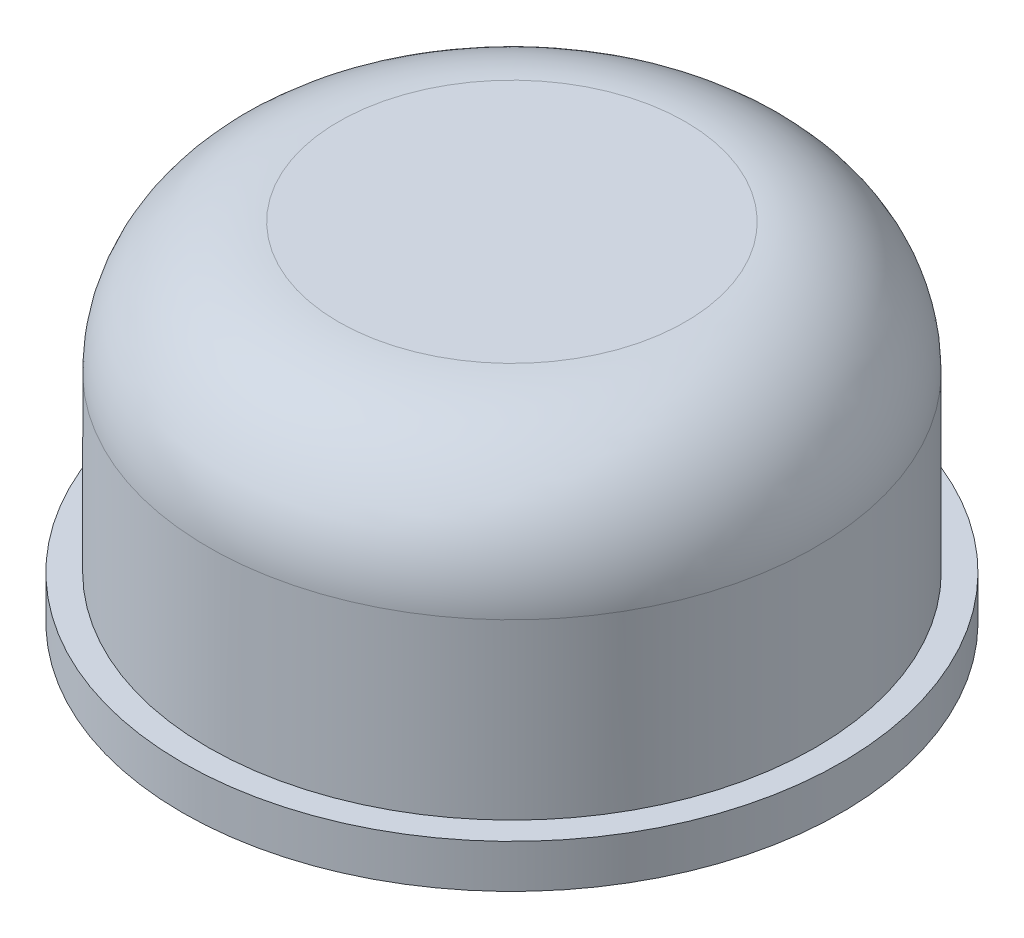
ISO-10303-21;
HEADER;
FILE_DESCRIPTION(('STEP AP214'),'2;1');
FILE_NAME('part.step','',(''),(''),'','','');
FILE_SCHEMA(('AUTOMOTIVE_DESIGN { 1 0 10303 214 1 1 1 1 }'));
ENDSEC;
DATA;
#1=APPLICATION_CONTEXT('core data for automotive mechanical design processes');
#2=APPLICATION_PROTOCOL_DEFINITION('international standard','automotive_design',2000,#1);
#3=PRODUCT_CONTEXT('',#1,'mechanical');
#4=PRODUCT('Part','Part','',(#3));
#5=PRODUCT_RELATED_PRODUCT_CATEGORY('part','',(#4));
#6=PRODUCT_DEFINITION_FORMATION('','',#4);
#7=PRODUCT_DEFINITION_CONTEXT('part definition',#1,'design');
#8=PRODUCT_DEFINITION('design','',#6,#7);
#9=PRODUCT_DEFINITION_SHAPE('','',#8);
#10=(LENGTH_UNIT() NAMED_UNIT(*) SI_UNIT(.MILLI.,.METRE.));
#11=(NAMED_UNIT(*) PLANE_ANGLE_UNIT() SI_UNIT($,.RADIAN.));
#12=(NAMED_UNIT(*) SI_UNIT($,.STERADIAN.) SOLID_ANGLE_UNIT());
#13=UNCERTAINTY_MEASURE_WITH_UNIT(LENGTH_MEASURE(1.E-05),#10,'distance_accuracy_value','');
#14=(GEOMETRIC_REPRESENTATION_CONTEXT(3) GLOBAL_UNCERTAINTY_ASSIGNED_CONTEXT((#13)) GLOBAL_UNIT_ASSIGNED_CONTEXT((#10,
#11,#12)) REPRESENTATION_CONTEXT('',''));
#15=CARTESIAN_POINT('',(0.,0.,0.));
#16=DIRECTION('',(0.,0.,1.));
#17=DIRECTION('',(1.,0.,0.));
#18=AXIS2_PLACEMENT_3D('',#15,#16,#17);
#19=CARTESIAN_POINT('',(0.,0.,0.));
#20=DIRECTION('',(0.,-1.,0.));
#21=DIRECTION('',(0.,0.,-1.));
#22=AXIS2_PLACEMENT_3D('',#19,#20,#21);
#23=PLANE('',#22);
#24=CARTESIAN_POINT('',(0.,0.,0.));
#25=DIRECTION('',(0.,-1.,0.));
#26=DIRECTION('',(0.,0.,-1.));
#27=AXIS2_PLACEMENT_3D('',#24,#25,#26);
#28=CIRCLE('',#27,8.12799999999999);
#29=CARTESIAN_POINT('',(0.,0.,-8.12799999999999));
#30=VERTEX_POINT('',#29);
#31=EDGE_CURVE('E40',#30,#30,#28,.T.);
#32=ORIENTED_EDGE('',*,*,#31,.F.);
#33=EDGE_LOOP('',(#32));
#34=FACE_BOUND('',#33,.T.);
#35=CARTESIAN_POINT('',(0.,0.,0.));
#36=DIRECTION('',(0.,1.,0.));
#37=DIRECTION('',(0.,0.,1.));
#38=AXIS2_PLACEMENT_3D('',#35,#36,#37);
#39=CIRCLE('',#38,9.65199999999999);
#40=CARTESIAN_POINT('',(0.,0.,9.65199999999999));
#41=VERTEX_POINT('',#40);
#42=EDGE_CURVE('E54',#41,#41,#39,.T.);
#43=ORIENTED_EDGE('',*,*,#42,.F.);
#44=EDGE_LOOP('',(#43));
#45=FACE_BOUND('',#44,.T.);
#46=ADVANCED_FACE('F26',(#34,#45),#23,.T.);
#47=CARTESIAN_POINT('',(0.,0.,0.));
#48=DIRECTION('',(0.,-1.,0.));
#49=DIRECTION('',(0.,0.,-1.));
#50=AXIS2_PLACEMENT_3D('',#47,#48,#49);
#51=CYLINDRICAL_SURFACE('',#50,8.12799999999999);
#52=CARTESIAN_POINT('',(0.,5.84200000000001,0.));
#53=DIRECTION('',(0.,-1.,0.));
#54=DIRECTION('',(0.,0.,-1.));
#55=AXIS2_PLACEMENT_3D('',#52,#53,#54);
#56=CIRCLE('',#55,8.12799999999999);
#57=CARTESIAN_POINT('',(0.,5.84200000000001,-8.12799999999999));
#58=VERTEX_POINT('',#57);
#59=EDGE_CURVE('E45',#58,#58,#56,.T.);
#60=ORIENTED_EDGE('',*,*,#59,.F.);
#61=EDGE_LOOP('',(#60));
#62=FACE_BOUND('',#61,.T.);
#63=ORIENTED_EDGE('',*,*,#31,.T.);
#64=EDGE_LOOP('',(#63));
#65=FACE_BOUND('',#64,.T.);
#66=ADVANCED_FACE('F61',(#62,#65),#51,.F.);
#67=CARTESIAN_POINT('',(0.,5.84200000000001,0.));
#68=DIRECTION('',(0.,-1.,0.));
#69=DIRECTION('',(0.,0.,-1.));
#70=AXIS2_PLACEMENT_3D('',#67,#68,#69);
#71=TOROIDAL_SURFACE('',#70,5.07999999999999,3.048);
#72=CARTESIAN_POINT('',(0.,8.89000000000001,0.));
#73=DIRECTION('',(0.,-1.,0.));
#74=DIRECTION('',(0.,0.,-1.));
#75=AXIS2_PLACEMENT_3D('',#72,#73,#74);
#76=CIRCLE('',#75,5.07999999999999);
#77=CARTESIAN_POINT('',(0.,8.89000000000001,-5.07999999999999));
#78=VERTEX_POINT('',#77);
#79=EDGE_CURVE('E48',#78,#78,#76,.T.);
#80=ORIENTED_EDGE('',*,*,#79,.F.);
#81=EDGE_LOOP('',(#80));
#82=FACE_BOUND('',#81,.T.);
#83=ORIENTED_EDGE('',*,*,#59,.T.);
#84=EDGE_LOOP('',(#83));
#85=FACE_BOUND('',#84,.T.);
#86=ADVANCED_FACE('F68',(#82,#85),#71,.F.);
#87=CARTESIAN_POINT('',(-5.07999999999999,8.89000000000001,2.06584931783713E-12));
#88=DIRECTION('',(0.,1.,0.));
#89=DIRECTION('',(0.,0.,1.));
#90=AXIS2_PLACEMENT_3D('',#87,#88,#89);
#91=PLANE('',#90);
#92=ORIENTED_EDGE('',*,*,#79,.T.);
#93=EDGE_LOOP('',(#92));
#94=FACE_BOUND('',#93,.T.);
#95=ADVANCED_FACE('F77',(#94),#91,.F.);
#96=CARTESIAN_POINT('',(0.,1.27,0.));
#97=DIRECTION('',(0.,1.,0.));
#98=DIRECTION('',(0.,0.,1.));
#99=AXIS2_PLACEMENT_3D('',#96,#97,#98);
#100=PLANE('',#99);
#101=CARTESIAN_POINT('',(0.,1.27,0.));
#102=DIRECTION('',(0.,1.,0.));
#103=DIRECTION('',(0.,0.,1.));
#104=AXIS2_PLACEMENT_3D('',#101,#102,#103);
#105=CIRCLE('',#104,9.65199999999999);
#106=CARTESIAN_POINT('',(0.,1.27,9.65199999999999));
#107=VERTEX_POINT('',#106);
#108=EDGE_CURVE('E51',#107,#107,#105,.T.);
#109=ORIENTED_EDGE('',*,*,#108,.T.);
#110=EDGE_LOOP('',(#109));
#111=FACE_BOUND('',#110,.T.);
#112=CARTESIAN_POINT('',(0.,1.27,0.));
#113=DIRECTION('',(0.,1.,0.));
#114=DIRECTION('',(0.,0.,1.));
#115=AXIS2_PLACEMENT_3D('',#112,#113,#114);
#116=CIRCLE('',#115,8.89);
#117=CARTESIAN_POINT('',(0.,1.27,8.89));
#118=VERTEX_POINT('',#117);
#119=EDGE_CURVE('E10',#118,#118,#116,.F.);
#120=ORIENTED_EDGE('',*,*,#119,.T.);
#121=EDGE_LOOP('',(#120));
#122=FACE_BOUND('',#121,.T.);
#123=ADVANCED_FACE('F102',(#111,#122),#100,.T.);
#124=CARTESIAN_POINT('',(0.,1.27,0.));
#125=DIRECTION('',(0.,-1.,0.));
#126=DIRECTION('',(0.,0.,-1.));
#127=AXIS2_PLACEMENT_3D('',#124,#125,#126);
#128=CYLINDRICAL_SURFACE('',#127,9.65199999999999);
#129=ORIENTED_EDGE('',*,*,#108,.F.);
#130=EDGE_LOOP('',(#129));
#131=FACE_BOUND('',#130,.T.);
#132=ORIENTED_EDGE('',*,*,#42,.T.);
#133=EDGE_LOOP('',(#132));
#134=FACE_BOUND('',#133,.T.);
#135=ADVANCED_FACE('F58',(#131,#134),#128,.T.);
#136=CARTESIAN_POINT('',(-5.08,10.16,2.06584931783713E-12));
#137=DIRECTION('',(0.,1.,0.));
#138=DIRECTION('',(0.,0.,1.));
#139=AXIS2_PLACEMENT_3D('',#136,#137,#138);
#140=PLANE('',#139);
#141=CARTESIAN_POINT('',(0.,10.16,0.));
#142=DIRECTION('',(0.,-1.,0.));
#143=DIRECTION('',(0.,0.,-1.));
#144=AXIS2_PLACEMENT_3D('',#141,#142,#143);
#145=CIRCLE('',#144,5.08);
#146=CARTESIAN_POINT('',(0.,10.16,-5.08));
#147=VERTEX_POINT('',#146);
#148=EDGE_CURVE('E36',#147,#147,#145,.T.);
#149=ORIENTED_EDGE('',*,*,#148,.F.);
#150=EDGE_LOOP('',(#149));
#151=FACE_BOUND('',#150,.T.);
#152=ADVANCED_FACE('F83',(#151),#140,.T.);
#153=CARTESIAN_POINT('',(0.,6.35000000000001,0.));
#154=DIRECTION('',(0.,-1.,0.));
#155=DIRECTION('',(0.,0.,-1.));
#156=AXIS2_PLACEMENT_3D('',#153,#154,#155);
#157=TOROIDAL_SURFACE('',#156,5.08,3.81);
#158=ORIENTED_EDGE('',*,*,#148,.T.);
#159=EDGE_LOOP('',(#158));
#160=FACE_BOUND('',#159,.T.);
#161=CARTESIAN_POINT('',(0.,6.35000000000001,0.));
#162=DIRECTION('',(0.,-1.,0.));
#163=DIRECTION('',(0.,0.,-1.));
#164=AXIS2_PLACEMENT_3D('',#161,#162,#163);
#165=CIRCLE('',#164,8.89);
#166=CARTESIAN_POINT('',(0.,6.35000000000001,-8.89));
#167=VERTEX_POINT('',#166);
#168=EDGE_CURVE('E32',#167,#167,#165,.T.);
#169=ORIENTED_EDGE('',*,*,#168,.F.);
#170=EDGE_LOOP('',(#169));
#171=FACE_BOUND('',#170,.T.);
#172=ADVANCED_FACE('F85',(#160,#171),#157,.T.);
#173=CARTESIAN_POINT('',(0.,0.,0.));
#174=DIRECTION('',(0.,-1.,0.));
#175=DIRECTION('',(0.,0.,-1.));
#176=AXIS2_PLACEMENT_3D('',#173,#174,#175);
#177=CYLINDRICAL_SURFACE('',#176,8.89);
#178=ORIENTED_EDGE('',*,*,#119,.F.);
#179=EDGE_LOOP('',(#178));
#180=FACE_BOUND('',#179,.T.);
#181=ORIENTED_EDGE('',*,*,#168,.T.);
#182=EDGE_LOOP('',(#181));
#183=FACE_BOUND('',#182,.T.);
#184=ADVANCED_FACE('F88',(#180,#183),#177,.T.);
#185=CLOSED_SHELL('',(#46,#66,#86,#95,#123,#135,#152,#172,#184));
#186=MANIFOLD_SOLID_BREP('B2',#185);
#187=ADVANCED_BREP_SHAPE_REPRESENTATION('',(#18,#186),#14);
#188=SHAPE_DEFINITION_REPRESENTATION(#9,#187);
ENDSEC;
END-ISO-10303-21;
